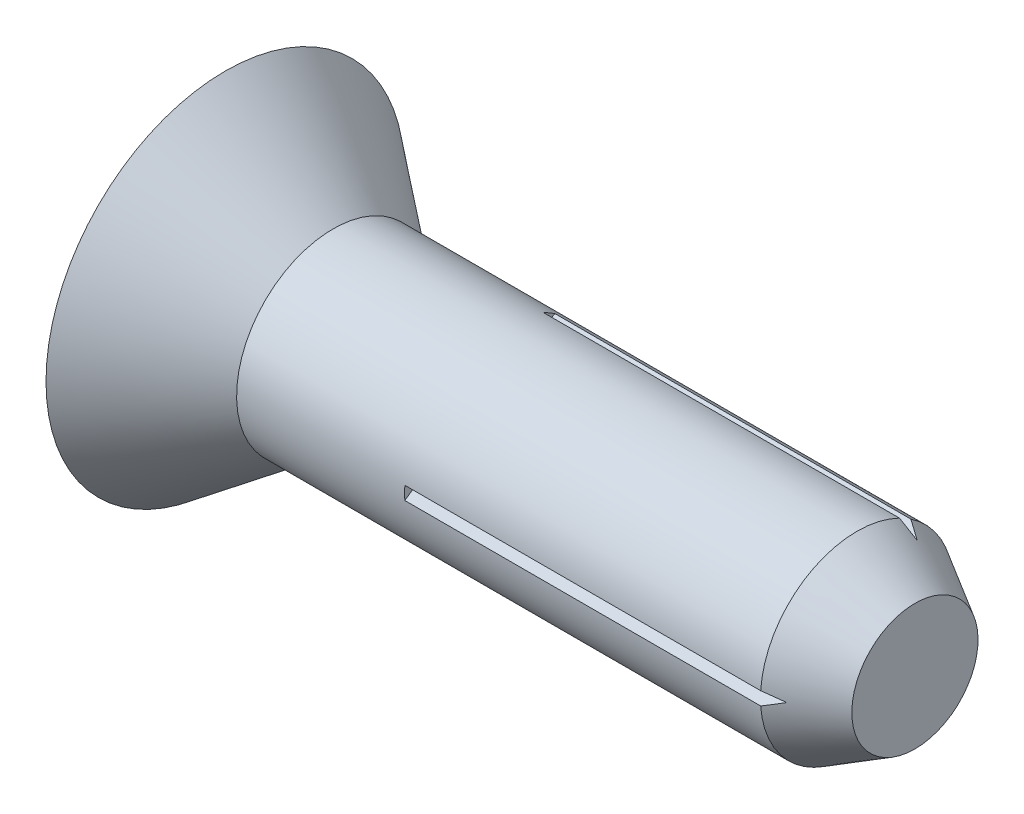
from build123d import *

# Parameters (mm, degrees)
CUT_EXTRUDE2_DEPTH = 3
CIRPATTERN2_COUNT  = 3


with BuildPart() as part:
    # Sketch1 → Base-Revolve (revolve)
    with BuildSketch(Plane(origin=(2.327621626, 1.627621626, 0), x_dir=(0, 1, 0), z_dir=(0, 0, 1)), mode=Mode.PRIVATE) as base_revolve_sk:
        Polygon((-1.627621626, -2.672378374), (-1.170108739, -2.672378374), (-0.927621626, -2.252378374), (-0.927621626, 2.327621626), (-1.627621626, 2.327621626), align=None)
    revolve(base_revolve_sk.sketch.rotate(Axis((-11.104148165, 0, 0), (1, 0, 0)), 180), axis=Axis((-11.104148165, 0, 0), (1, 0, 0)))

    # Sketch6 → Cut-Extrude2 (cut)
    with BuildSketch(Plane(origin=(5, 0, 0), x_dir=(0, 0, -1), z_dir=(1, 0, 0))):
        Polygon((-0.7, 0.049014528), (-0.63, 0), (-0.7, -0.049014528), align=None)
    cut_extrude2 = extrude(amount=-CUT_EXTRUDE2_DEPTH, mode=Mode.SUBTRACT)

    # CirPattern2: Cut-Extrude2 ×3 about axis
    cirpattern2_axis = Axis((0, 0, 0), (1, 0, 0))
    for i in range(1, CIRPATTERN2_COUNT):
        add(cut_extrude2.rotate(cirpattern2_axis, i * 360 / CIRPATTERN2_COUNT), mode=Mode.SUBTRACT)

    # Sketch7 → Revolve2 (revolve)
    with BuildSketch(Plane(origin=(3.60056552, 2.30056552, 0), x_dir=(0, 1, 0), z_dir=(0, 0, 1)), mode=Mode.PRIVATE) as revolve2_sk:
        Polygon((-2.30056552, 3.60056552), (-1.00056552, 3.60056552), (-1.60056552, 2.818630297), (-2.30056552, 2.818630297), align=None)
    revolve(revolve2_sk.sketch.rotate(Axis((-0.440243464, 0, 0), (1, 0, 0)), 180), axis=Axis((-0.440243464, 0, 0), (1, 0, 0)))


solid = part.part
